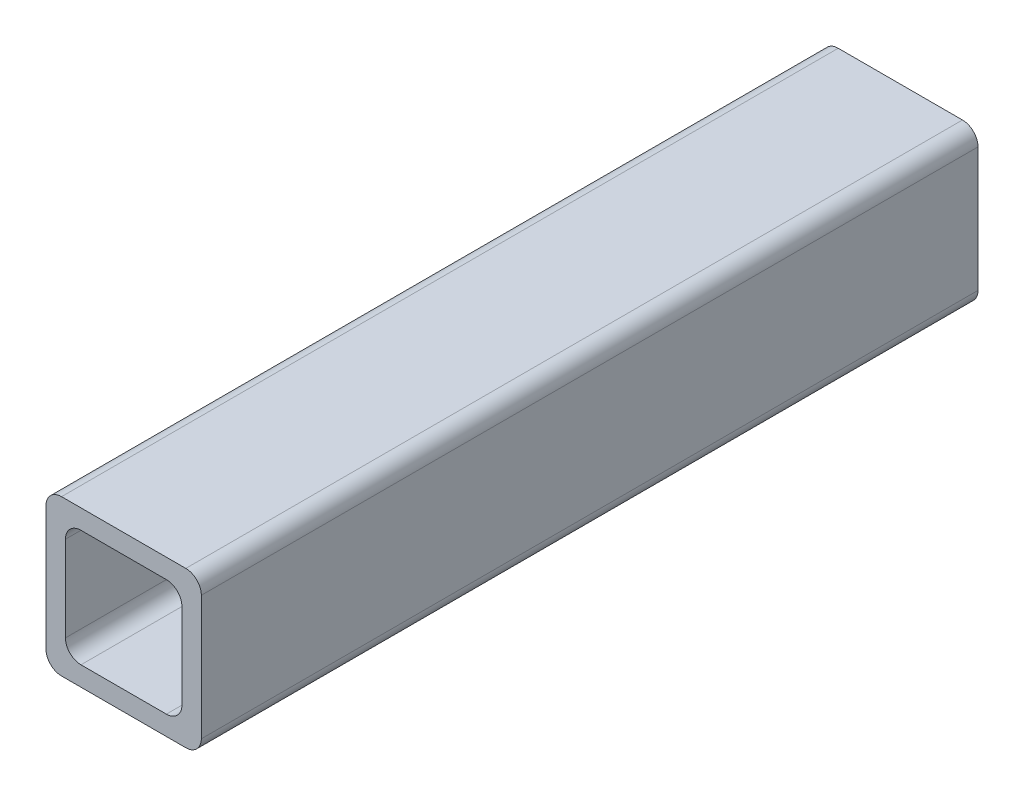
from build123d import *

# Parameters (mm, degrees)
BOSS_EXTRU_2_DEPTH = 100


with BuildPart() as part:
    # Esquisse1 → Boss.-Extru.2 (new body)
    with BuildSketch(Plane.XY):
        with BuildLine():
            Line((6.49902662, -10), (-9.50097338, -10))
            ThreePointArc((-9.50097338, -10), (-10.915186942, -9.414213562), (-11.50097338, -8))
            Line((-11.50097338, -8), (-11.50097338, 8))
            ThreePointArc((-11.50097338, 8), (-10.915186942, 9.414213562), (-9.50097338, 10))
            Line((-9.50097338, 10), (6.49902662, 10))
            ThreePointArc((6.49902662, 10), (7.913240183, 9.414213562), (8.49902662, 8))
            Line((8.49902662, 8), (8.49902662, -8))
            ThreePointArc((8.49902662, -8), (7.913240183, -9.414213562), (6.49902662, -10))
        make_face()
        with BuildLine():
            Line((3.99902662, 7.5), (-7.00097338, 7.5))
            ThreePointArc((-7.00097338, 7.5), (-8.415186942, 6.914213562), (-9.00097338, 5.5))
            Line((-9.00097338, 5.5), (-9.00097338, -5.5))
            ThreePointArc((-9.00097338, -5.5), (-8.415186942, -6.914213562), (-7.00097338, -7.5))
            Line((-7.00097338, -7.5), (3.99902662, -7.5))
            ThreePointArc((3.99902662, -7.5), (5.413240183, -6.914213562), (5.99902662, -5.5))
            Line((5.99902662, -5.5), (5.99902662, 5.5))
            ThreePointArc((5.99902662, 5.5), (5.413240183, 6.914213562), (3.99902662, 7.5))
        make_face(mode=Mode.SUBTRACT)
    extrude(amount=BOSS_EXTRU_2_DEPTH)


solid = part.part
